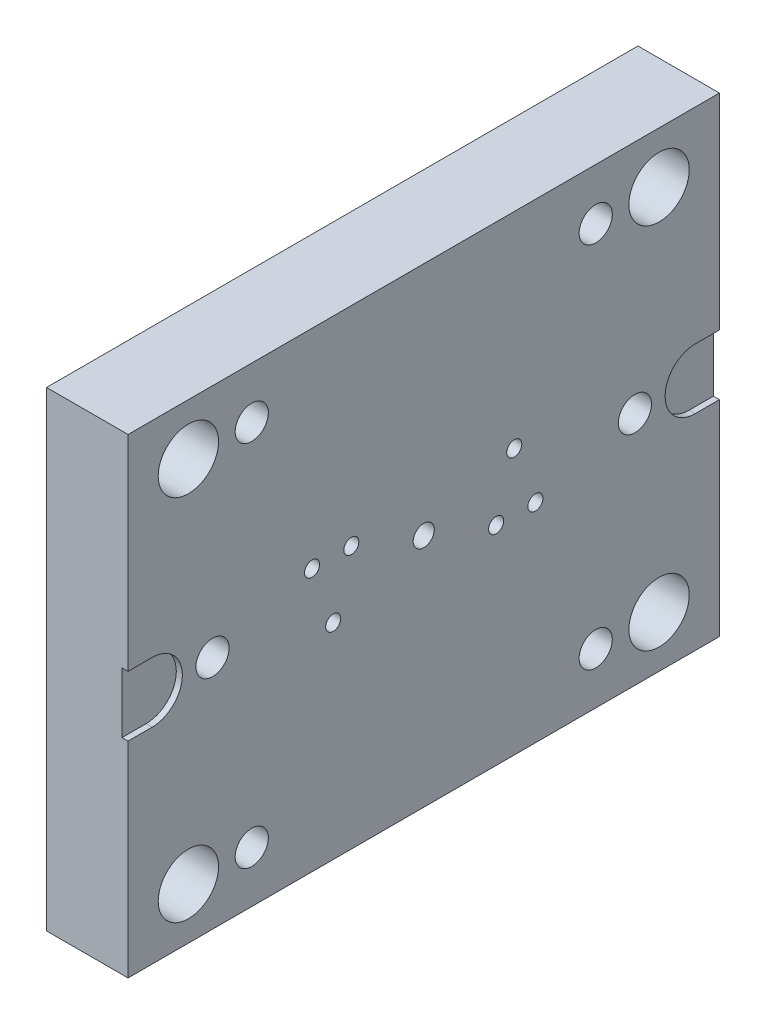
ISO-10303-21;
HEADER;
FILE_DESCRIPTION(('STEP AP214'),'2;1');
FILE_NAME('part.step','',(''),(''),'','','');
FILE_SCHEMA(('AUTOMOTIVE_DESIGN { 1 0 10303 214 1 1 1 1 }'));
ENDSEC;
DATA;
#1=APPLICATION_CONTEXT('core data for automotive mechanical design processes');
#2=APPLICATION_PROTOCOL_DEFINITION('international standard','automotive_design',2000,#1);
#3=PRODUCT_CONTEXT('',#1,'mechanical');
#4=PRODUCT('Part','Part','',(#3));
#5=PRODUCT_RELATED_PRODUCT_CATEGORY('part','',(#4));
#6=PRODUCT_DEFINITION_FORMATION('','',#4);
#7=PRODUCT_DEFINITION_CONTEXT('part definition',#1,'design');
#8=PRODUCT_DEFINITION('design','',#6,#7);
#9=PRODUCT_DEFINITION_SHAPE('','',#8);
#10=(LENGTH_UNIT() NAMED_UNIT(*) SI_UNIT(.MILLI.,.METRE.));
#11=(NAMED_UNIT(*) PLANE_ANGLE_UNIT() SI_UNIT($,.RADIAN.));
#12=(NAMED_UNIT(*) SI_UNIT($,.STERADIAN.) SOLID_ANGLE_UNIT());
#13=UNCERTAINTY_MEASURE_WITH_UNIT(LENGTH_MEASURE(1.E-05),#10,'distance_accuracy_value','');
#14=(GEOMETRIC_REPRESENTATION_CONTEXT(3) GLOBAL_UNCERTAINTY_ASSIGNED_CONTEXT((#13)) GLOBAL_UNIT_ASSIGNED_CONTEXT((#10,
#11,#12)) REPRESENTATION_CONTEXT('',''));
#15=CARTESIAN_POINT('',(0.,0.,0.));
#16=DIRECTION('',(0.,0.,1.));
#17=DIRECTION('',(1.,0.,0.));
#18=AXIS2_PLACEMENT_3D('',#15,#16,#17);
#19=CARTESIAN_POINT('',(-102.,78.,98.0000000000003));
#20=DIRECTION('',(-1.,0.,0.));
#21=DIRECTION('',(0.,0.,1.));
#22=AXIS2_PLACEMENT_3D('',#19,#20,#21);
#23=PLANE('',#22);
#24=CARTESIAN_POINT('',(-102.,77.9999999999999,168.));
#25=DIRECTION('',(1.,0.,0.));
#26=DIRECTION('',(0.,0.,-1.));
#27=AXIS2_PLACEMENT_3D('',#24,#25,#26);
#28=CIRCLE('',#27,5.50000000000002);
#29=CARTESIAN_POINT('',(-102.,77.9999999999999,162.5));
#30=VERTEX_POINT('',#29);
#31=EDGE_CURVE('E184',#30,#30,#28,.T.);
#32=ORIENTED_EDGE('',*,*,#31,.T.);
#33=EDGE_LOOP('',(#32));
#34=FACE_BOUND('',#33,.T.);
#35=CARTESIAN_POINT('',(-102.,77.9999999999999,28.0000000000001));
#36=DIRECTION('',(1.,0.,0.));
#37=DIRECTION('',(0.,0.,-1.));
#38=AXIS2_PLACEMENT_3D('',#35,#36,#37);
#39=CIRCLE('',#38,5.5);
#40=CARTESIAN_POINT('',(-102.,77.9999999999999,22.5000000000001));
#41=VERTEX_POINT('',#40);
#42=EDGE_CURVE('E190',#41,#41,#39,.T.);
#43=ORIENTED_EDGE('',*,*,#42,.T.);
#44=EDGE_LOOP('',(#43));
#45=FACE_BOUND('',#44,.T.);
#46=CARTESIAN_POINT('',(-102.,78.,98.0000000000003));
#47=DIRECTION('',(1.,0.,0.));
#48=DIRECTION('',(0.,0.,-1.));
#49=AXIS2_PLACEMENT_3D('',#46,#47,#48);
#50=CIRCLE('',#49,3.50000000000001);
#51=CARTESIAN_POINT('',(-102.,78.,94.5000000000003));
#52=VERTEX_POINT('',#51);
#53=EDGE_CURVE('E196',#52,#52,#50,.T.);
#54=ORIENTED_EDGE('',*,*,#53,.T.);
#55=EDGE_LOOP('',(#54));
#56=FACE_BOUND('',#55,.T.);
#57=CARTESIAN_POINT('',(-102.,69.,61.0000000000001));
#58=DIRECTION('',(1.,0.,0.));
#59=DIRECTION('',(0.,0.,-1.));
#60=AXIS2_PLACEMENT_3D('',#57,#58,#59);
#61=CIRCLE('',#60,2.5);
#62=CARTESIAN_POINT('',(-102.,69.,58.5000000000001));
#63=VERTEX_POINT('',#62);
#64=EDGE_CURVE('E202',#63,#63,#61,.T.);
#65=ORIENTED_EDGE('',*,*,#64,.T.);
#66=EDGE_LOOP('',(#65));
#67=FACE_BOUND('',#66,.T.);
#68=CARTESIAN_POINT('',(-102.,69.,74.0000000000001));
#69=DIRECTION('',(1.,0.,0.));
#70=DIRECTION('',(0.,0.,-1.));
#71=AXIS2_PLACEMENT_3D('',#68,#69,#70);
#72=CIRCLE('',#71,2.5);
#73=CARTESIAN_POINT('',(-102.,69.,71.5000000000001));
#74=VERTEX_POINT('',#73);
#75=EDGE_CURVE('E208',#74,#74,#72,.T.);
#76=ORIENTED_EDGE('',*,*,#75,.T.);
#77=EDGE_LOOP('',(#76));
#78=FACE_BOUND('',#77,.T.);
#79=CARTESIAN_POINT('',(-102.,88.,68.0000000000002));
#80=DIRECTION('',(1.,0.,0.));
#81=DIRECTION('',(0.,0.,-1.));
#82=AXIS2_PLACEMENT_3D('',#79,#80,#81);
#83=CIRCLE('',#82,2.50000000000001);
#84=CARTESIAN_POINT('',(-102.,88.,65.5000000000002));
#85=VERTEX_POINT('',#84);
#86=EDGE_CURVE('E214',#85,#85,#83,.T.);
#87=ORIENTED_EDGE('',*,*,#86,.T.);
#88=EDGE_LOOP('',(#87));
#89=FACE_BOUND('',#88,.T.);
#90=CARTESIAN_POINT('',(-102.,68.,128.));
#91=DIRECTION('',(1.,0.,0.));
#92=DIRECTION('',(0.,0.,-1.));
#93=AXIS2_PLACEMENT_3D('',#90,#91,#92);
#94=CIRCLE('',#93,2.5);
#95=CARTESIAN_POINT('',(-102.,68.,125.5));
#96=VERTEX_POINT('',#95);
#97=EDGE_CURVE('E220',#96,#96,#94,.T.);
#98=ORIENTED_EDGE('',*,*,#97,.T.);
#99=EDGE_LOOP('',(#98));
#100=FACE_BOUND('',#99,.T.);
#101=CARTESIAN_POINT('',(-102.,87.0000000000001,122.));
#102=DIRECTION('',(1.,0.,0.));
#103=DIRECTION('',(0.,0.,-1.));
#104=AXIS2_PLACEMENT_3D('',#101,#102,#103);
#105=CIRCLE('',#104,2.5);
#106=CARTESIAN_POINT('',(-102.,87.0000000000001,119.5));
#107=VERTEX_POINT('',#106);
#108=EDGE_CURVE('E226',#107,#107,#105,.T.);
#109=ORIENTED_EDGE('',*,*,#108,.T.);
#110=EDGE_LOOP('',(#109));
#111=FACE_BOUND('',#110,.T.);
#112=CARTESIAN_POINT('',(-102.,87.,135.));
#113=DIRECTION('',(1.,0.,0.));
#114=DIRECTION('',(0.,0.,-1.));
#115=AXIS2_PLACEMENT_3D('',#112,#113,#114);
#116=CIRCLE('',#115,2.5);
#117=CARTESIAN_POINT('',(-102.,87.,132.5));
#118=VERTEX_POINT('',#117);
#119=EDGE_CURVE('E232',#118,#118,#116,.T.);
#120=ORIENTED_EDGE('',*,*,#119,.T.);
#121=EDGE_LOOP('',(#120));
#122=FACE_BOUND('',#121,.T.);
#123=CARTESIAN_POINT('',(-102.,139.,155.));
#124=DIRECTION('',(-1.,0.,0.));
#125=DIRECTION('',(0.,0.,1.));
#126=AXIS2_PLACEMENT_3D('',#123,#124,#125);
#127=CIRCLE('',#126,5.5);
#128=CARTESIAN_POINT('',(-102.,139.,160.5));
#129=VERTEX_POINT('',#128);
#130=EDGE_CURVE('E235',#129,#129,#127,.T.);
#131=ORIENTED_EDGE('',*,*,#130,.F.);
#132=EDGE_LOOP('',(#131));
#133=FACE_BOUND('',#132,.T.);
#134=CARTESIAN_POINT('',(-102.,139.,41.0000000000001));
#135=DIRECTION('',(-1.,0.,0.));
#136=DIRECTION('',(0.,0.,1.));
#137=AXIS2_PLACEMENT_3D('',#134,#135,#136);
#138=CIRCLE('',#137,5.5);
#139=CARTESIAN_POINT('',(-102.,139.,46.5000000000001));
#140=VERTEX_POINT('',#139);
#141=EDGE_CURVE('E239',#140,#140,#138,.T.);
#142=ORIENTED_EDGE('',*,*,#141,.F.);
#143=EDGE_LOOP('',(#142));
#144=FACE_BOUND('',#143,.T.);
#145=CARTESIAN_POINT('',(-102.,17.,155.));
#146=DIRECTION('',(-1.,0.,0.));
#147=DIRECTION('',(0.,0.,1.));
#148=AXIS2_PLACEMENT_3D('',#145,#146,#147);
#149=CIRCLE('',#148,5.5);
#150=CARTESIAN_POINT('',(-102.,17.,160.5));
#151=VERTEX_POINT('',#150);
#152=EDGE_CURVE('E243',#151,#151,#149,.T.);
#153=ORIENTED_EDGE('',*,*,#152,.F.);
#154=EDGE_LOOP('',(#153));
#155=FACE_BOUND('',#154,.T.);
#156=CARTESIAN_POINT('',(-102.,17.,41.0000000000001));
#157=DIRECTION('',(-1.,0.,0.));
#158=DIRECTION('',(0.,0.,1.));
#159=AXIS2_PLACEMENT_3D('',#156,#157,#158);
#160=CIRCLE('',#159,5.5);
#161=CARTESIAN_POINT('',(-102.,17.,46.5000000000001));
#162=VERTEX_POINT('',#161);
#163=EDGE_CURVE('E247',#162,#162,#160,.T.);
#164=ORIENTED_EDGE('',*,*,#163,.F.);
#165=EDGE_LOOP('',(#164));
#166=FACE_BOUND('',#165,.T.);
#167=CARTESIAN_POINT('',(-102.,139.,176.));
#168=DIRECTION('',(-1.,0.,0.));
#169=DIRECTION('',(0.,0.,1.));
#170=AXIS2_PLACEMENT_3D('',#167,#168,#169);
#171=CIRCLE('',#170,10.);
#172=CARTESIAN_POINT('',(-102.,139.,186.));
#173=VERTEX_POINT('',#172);
#174=EDGE_CURVE('E251',#173,#173,#171,.T.);
#175=ORIENTED_EDGE('',*,*,#174,.F.);
#176=EDGE_LOOP('',(#175));
#177=FACE_BOUND('',#176,.T.);
#178=CARTESIAN_POINT('',(-102.,139.,20.0000000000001));
#179=DIRECTION('',(-1.,0.,0.));
#180=DIRECTION('',(0.,0.,1.));
#181=AXIS2_PLACEMENT_3D('',#178,#179,#180);
#182=CIRCLE('',#181,10.);
#183=CARTESIAN_POINT('',(-102.,139.,30.0000000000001));
#184=VERTEX_POINT('',#183);
#185=EDGE_CURVE('E255',#184,#184,#182,.T.);
#186=ORIENTED_EDGE('',*,*,#185,.F.);
#187=EDGE_LOOP('',(#186));
#188=FACE_BOUND('',#187,.T.);
#189=CARTESIAN_POINT('',(-102.,17.,176.));
#190=DIRECTION('',(-1.,0.,0.));
#191=DIRECTION('',(0.,0.,1.));
#192=AXIS2_PLACEMENT_3D('',#189,#190,#191);
#193=CIRCLE('',#192,10.);
#194=CARTESIAN_POINT('',(-102.,17.,186.));
#195=VERTEX_POINT('',#194);
#196=EDGE_CURVE('E259',#195,#195,#193,.T.);
#197=ORIENTED_EDGE('',*,*,#196,.F.);
#198=EDGE_LOOP('',(#197));
#199=FACE_BOUND('',#198,.T.);
#200=CARTESIAN_POINT('',(-102.,17.,20.0000000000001));
#201=DIRECTION('',(-1.,0.,0.));
#202=DIRECTION('',(0.,0.,1.));
#203=AXIS2_PLACEMENT_3D('',#200,#201,#202);
#204=CIRCLE('',#203,10.);
#205=CARTESIAN_POINT('',(-102.,17.,30.0000000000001));
#206=VERTEX_POINT('',#205);
#207=EDGE_CURVE('E263',#206,#206,#204,.T.);
#208=ORIENTED_EDGE('',*,*,#207,.F.);
#209=EDGE_LOOP('',(#208));
#210=FACE_BOUND('',#209,.T.);
#211=DIRECTION('',(0.,0.,-1.));
#212=VECTOR('',#211,1.);
#213=CARTESIAN_POINT('',(-102.,0.,98.0000000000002));
#214=LINE('',#213,#212);
#215=CARTESIAN_POINT('',(-102.,0.,196.));
#216=VERTEX_POINT('',#215);
#217=CARTESIAN_POINT('',(-102.,0.,0.));
#218=VERTEX_POINT('',#217);
#219=EDGE_CURVE('E11',#216,#218,#214,.T.);
#220=ORIENTED_EDGE('',*,*,#219,.F.);
#221=DIRECTION('',(0.,-1.,0.));
#222=VECTOR('',#221,1.);
#223=CARTESIAN_POINT('',(-102.,78.,196.));
#224=LINE('',#223,#222);
#225=CARTESIAN_POINT('',(-102.,156.,196.));
#226=VERTEX_POINT('',#225);
#227=EDGE_CURVE('E291',#226,#216,#224,.T.);
#228=ORIENTED_EDGE('',*,*,#227,.F.);
#229=DIRECTION('',(0.,0.,1.));
#230=VECTOR('',#229,1.);
#231=CARTESIAN_POINT('',(-102.,156.,98.0000000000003));
#232=LINE('',#231,#230);
#233=CARTESIAN_POINT('',(-102.,156.,0.));
#234=VERTEX_POINT('',#233);
#235=EDGE_CURVE('E294',#234,#226,#232,.T.);
#236=ORIENTED_EDGE('',*,*,#235,.F.);
#237=DIRECTION('',(0.,1.,0.));
#238=VECTOR('',#237,1.);
#239=CARTESIAN_POINT('',(-102.,78.,0.));
#240=LINE('',#239,#238);
#241=EDGE_CURVE('E36',#218,#234,#240,.T.);
#242=ORIENTED_EDGE('',*,*,#241,.F.);
#243=EDGE_LOOP('',(#220,#228,#236,#242));
#244=FACE_BOUND('',#243,.T.);
#245=ADVANCED_FACE('F28',(#34,#45,#56,#67,#78,#89,#100,#111,#122,#133,#144,#155,#166,#177,#188,
#199,#210,#244),#23,.T.);
#246=CARTESIAN_POINT('',(-75.,0.,98.0000000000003));
#247=DIRECTION('',(0.,-1.,0.));
#248=DIRECTION('',(1.,0.,0.));
#249=AXIS2_PLACEMENT_3D('',#246,#247,#248);
#250=PLANE('',#249);
#251=DIRECTION('',(-1.,0.,0.));
#252=VECTOR('',#251,1.);
#253=CARTESIAN_POINT('',(-75.,0.,196.));
#254=LINE('',#253,#252);
#255=CARTESIAN_POINT('',(-75.,0.,196.));
#256=VERTEX_POINT('',#255);
#257=EDGE_CURVE('E273',#256,#216,#254,.T.);
#258=ORIENTED_EDGE('',*,*,#257,.T.);
#259=ORIENTED_EDGE('',*,*,#219,.T.);
#260=DIRECTION('',(-1.,0.,0.));
#261=VECTOR('',#260,1.);
#262=CARTESIAN_POINT('',(-75.,0.,0.));
#263=LINE('',#262,#261);
#264=CARTESIAN_POINT('',(-75.,0.,0.));
#265=VERTEX_POINT('',#264);
#266=EDGE_CURVE('E288',#265,#218,#263,.T.);
#267=ORIENTED_EDGE('',*,*,#266,.F.);
#268=DIRECTION('',(0.,0.,1.));
#269=VECTOR('',#268,1.);
#270=CARTESIAN_POINT('',(-75.,0.,98.0000000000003));
#271=LINE('',#270,#269);
#272=EDGE_CURVE('E266',#265,#256,#271,.T.);
#273=ORIENTED_EDGE('',*,*,#272,.T.);
#274=EDGE_LOOP('',(#258,#259,#267,#273));
#275=FACE_BOUND('',#274,.T.);
#276=ADVANCED_FACE('F345',(#275),#250,.T.);
#277=CARTESIAN_POINT('',(-75.,78.0000000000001,0.));
#278=DIRECTION('',(0.,0.,-1.));
#279=DIRECTION('',(-1.,0.,0.));
#280=AXIS2_PLACEMENT_3D('',#277,#278,#279);
#281=PLANE('',#280);
#282=DIRECTION('',(1.,0.,0.));
#283=VECTOR('',#282,1.);
#284=CARTESIAN_POINT('',(-77.,88.0000000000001,0.));
#285=LINE('',#284,#283);
#286=CARTESIAN_POINT('',(-77.,88.0000000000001,0.));
#287=VERTEX_POINT('',#286);
#288=CARTESIAN_POINT('',(-75.,88.0000000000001,0.));
#289=VERTEX_POINT('',#288);
#290=EDGE_CURVE('E176',#287,#289,#285,.T.);
#291=ORIENTED_EDGE('',*,*,#290,.F.);
#292=DIRECTION('',(0.,1.,0.));
#293=VECTOR('',#292,1.);
#294=CARTESIAN_POINT('',(-77.,88.0000000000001,0.));
#295=LINE('',#294,#293);
#296=CARTESIAN_POINT('',(-77.,68.0000000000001,0.));
#297=VERTEX_POINT('',#296);
#298=EDGE_CURVE('E167',#297,#287,#295,.T.);
#299=ORIENTED_EDGE('',*,*,#298,.F.);
#300=DIRECTION('',(1.,0.,0.));
#301=VECTOR('',#300,1.);
#302=CARTESIAN_POINT('',(-77.,68.0000000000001,0.));
#303=LINE('',#302,#301);
#304=CARTESIAN_POINT('',(-75.,68.0000000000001,0.));
#305=VERTEX_POINT('',#304);
#306=EDGE_CURVE('E178',#297,#305,#303,.T.);
#307=ORIENTED_EDGE('',*,*,#306,.T.);
#308=DIRECTION('',(0.,-1.,0.));
#309=VECTOR('',#308,1.);
#310=CARTESIAN_POINT('',(-75.,78.0000000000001,0.));
#311=LINE('',#310,#309);
#312=EDGE_CURVE('E269',#305,#265,#311,.T.);
#313=ORIENTED_EDGE('',*,*,#312,.T.);
#314=ORIENTED_EDGE('',*,*,#266,.T.);
#315=ORIENTED_EDGE('',*,*,#241,.T.);
#316=DIRECTION('',(-1.,0.,0.));
#317=VECTOR('',#316,1.);
#318=CARTESIAN_POINT('',(-75.,156.,0.));
#319=LINE('',#318,#317);
#320=CARTESIAN_POINT('',(-75.,156.,0.));
#321=VERTEX_POINT('',#320);
#322=EDGE_CURVE('E285',#321,#234,#319,.T.);
#323=ORIENTED_EDGE('',*,*,#322,.F.);
#324=EDGE_CURVE('E277',#321,#289,#311,.T.);
#325=ORIENTED_EDGE('',*,*,#324,.T.);
#326=EDGE_LOOP('',(#291,#299,#307,#313,#314,#315,#323,#325));
#327=FACE_BOUND('',#326,.T.);
#328=ADVANCED_FACE('F350',(#327),#281,.T.);
#329=CARTESIAN_POINT('',(-75.,156.,98.0000000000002));
#330=DIRECTION('',(0.,1.,0.));
#331=DIRECTION('',(-1.,0.,0.));
#332=AXIS2_PLACEMENT_3D('',#329,#330,#331);
#333=PLANE('',#332);
#334=ORIENTED_EDGE('',*,*,#322,.T.);
#335=ORIENTED_EDGE('',*,*,#235,.T.);
#336=DIRECTION('',(-1.,0.,0.));
#337=VECTOR('',#336,1.);
#338=CARTESIAN_POINT('',(-75.,156.,196.000000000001));
#339=LINE('',#338,#337);
#340=CARTESIAN_POINT('',(-75.,156.,196.000000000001));
#341=VERTEX_POINT('',#340);
#342=EDGE_CURVE('E282',#341,#226,#339,.T.);
#343=ORIENTED_EDGE('',*,*,#342,.F.);
#344=DIRECTION('',(0.,0.,-1.));
#345=VECTOR('',#344,1.);
#346=CARTESIAN_POINT('',(-75.,156.,98.0000000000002));
#347=LINE('',#346,#345);
#348=EDGE_CURVE('E274',#341,#321,#347,.T.);
#349=ORIENTED_EDGE('',*,*,#348,.T.);
#350=EDGE_LOOP('',(#334,#335,#343,#349));
#351=FACE_BOUND('',#350,.T.);
#352=ADVANCED_FACE('F316',(#351),#333,.T.);
#353=CARTESIAN_POINT('',(-75.,78.0000000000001,98.0000000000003));
#354=DIRECTION('',(1.,0.,0.));
#355=DIRECTION('',(0.,0.,-1.));
#356=AXIS2_PLACEMENT_3D('',#353,#354,#355);
#357=PLANE('',#356);
#358=DIRECTION('',(0.,0.,-1.));
#359=VECTOR('',#358,1.);
#360=CARTESIAN_POINT('',(-75.,68.0000000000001,196.000000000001));
#361=LINE('',#360,#359);
#362=CARTESIAN_POINT('',(-75.,68.0000000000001,196.000000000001));
#363=VERTEX_POINT('',#362);
#364=CARTESIAN_POINT('',(-75.,68.0000000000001,188.000000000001));
#365=VERTEX_POINT('',#364);
#366=EDGE_CURVE('E140',#363,#365,#361,.T.);
#367=ORIENTED_EDGE('',*,*,#366,.F.);
#368=DIRECTION('',(0.,1.,0.));
#369=VECTOR('',#368,1.);
#370=CARTESIAN_POINT('',(-75.,78.0000000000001,196.000000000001));
#371=LINE('',#370,#369);
#372=EDGE_CURVE('E270',#256,#363,#371,.T.);
#373=ORIENTED_EDGE('',*,*,#372,.F.);
#374=ORIENTED_EDGE('',*,*,#272,.F.);
#375=ORIENTED_EDGE('',*,*,#312,.F.);
#376=DIRECTION('',(0.,0.,-1.));
#377=VECTOR('',#376,1.);
#378=CARTESIAN_POINT('',(-75.,68.0000000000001,0.));
#379=LINE('',#378,#377);
#380=CARTESIAN_POINT('',(-75.,68.0000000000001,8.00000000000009));
#381=VERTEX_POINT('',#380);
#382=EDGE_CURVE('E156',#381,#305,#379,.T.);
#383=ORIENTED_EDGE('',*,*,#382,.F.);
#384=CARTESIAN_POINT('',(-75.,78.0000000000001,8.00000000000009));
#385=DIRECTION('',(1.,0.,0.));
#386=DIRECTION('',(0.,0.,-1.));
#387=AXIS2_PLACEMENT_3D('',#384,#385,#386);
#388=CIRCLE('',#387,9.99999999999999);
#389=CARTESIAN_POINT('',(-75.,88.0000000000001,8.00000000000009));
#390=VERTEX_POINT('',#389);
#391=EDGE_CURVE('E52',#390,#381,#388,.T.);
#392=ORIENTED_EDGE('',*,*,#391,.F.);
#393=DIRECTION('',(0.,0.,1.));
#394=VECTOR('',#393,1.);
#395=CARTESIAN_POINT('',(-75.,88.0000000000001,8.00000000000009));
#396=LINE('',#395,#394);
#397=EDGE_CURVE('E158',#289,#390,#396,.T.);
#398=ORIENTED_EDGE('',*,*,#397,.F.);
#399=ORIENTED_EDGE('',*,*,#324,.F.);
#400=ORIENTED_EDGE('',*,*,#348,.F.);
#401=CARTESIAN_POINT('',(-75.,88.0000000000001,196.000000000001));
#402=VERTEX_POINT('',#401);
#403=EDGE_CURVE('E139',#402,#341,#371,.T.);
#404=ORIENTED_EDGE('',*,*,#403,.F.);
#405=DIRECTION('',(0.,0.,1.));
#406=VECTOR('',#405,1.);
#407=CARTESIAN_POINT('',(-75.,88.0000000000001,188.000000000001));
#408=LINE('',#407,#406);
#409=CARTESIAN_POINT('',(-75.,88.0000000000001,188.000000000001));
#410=VERTEX_POINT('',#409);
#411=EDGE_CURVE('E120',#410,#402,#408,.T.);
#412=ORIENTED_EDGE('',*,*,#411,.F.);
#413=CARTESIAN_POINT('',(-75.,78.0000000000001,188.000000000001));
#414=DIRECTION('',(1.,0.,0.));
#415=DIRECTION('',(0.,0.,1.));
#416=AXIS2_PLACEMENT_3D('',#413,#414,#415);
#417=CIRCLE('',#416,9.99999999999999);
#418=EDGE_CURVE('E128',#365,#410,#417,.T.);
#419=ORIENTED_EDGE('',*,*,#418,.F.);
#420=EDGE_LOOP('',(#367,#373,#374,#375,#383,#392,#398,#399,#400,#404,#412,#419));
#421=FACE_BOUND('',#420,.T.);
#422=CARTESIAN_POINT('',(-75.,77.9999999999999,168.));
#423=DIRECTION('',(1.,0.,0.));
#424=DIRECTION('',(0.,0.,-1.));
#425=AXIS2_PLACEMENT_3D('',#422,#423,#424);
#426=CIRCLE('',#425,5.50000000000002);
#427=CARTESIAN_POINT('',(-75.,77.9999999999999,162.5));
#428=VERTEX_POINT('',#427);
#429=EDGE_CURVE('E175',#428,#428,#426,.T.);
#430=ORIENTED_EDGE('',*,*,#429,.F.);
#431=EDGE_LOOP('',(#430));
#432=FACE_BOUND('',#431,.T.);
#433=CARTESIAN_POINT('',(-74.9999999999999,78.,28.0000000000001));
#434=DIRECTION('',(1.,0.,0.));
#435=DIRECTION('',(0.,0.,-1.));
#436=AXIS2_PLACEMENT_3D('',#433,#434,#435);
#437=CIRCLE('',#436,5.5);
#438=CARTESIAN_POINT('',(-74.9999999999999,78.,22.5000000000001));
#439=VERTEX_POINT('',#438);
#440=EDGE_CURVE('E187',#439,#439,#437,.T.);
#441=ORIENTED_EDGE('',*,*,#440,.F.);
#442=EDGE_LOOP('',(#441));
#443=FACE_BOUND('',#442,.T.);
#444=CARTESIAN_POINT('',(-75.,78.0000000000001,98.0000000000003));
#445=DIRECTION('',(1.,0.,0.));
#446=DIRECTION('',(0.,0.,-1.));
#447=AXIS2_PLACEMENT_3D('',#444,#445,#446);
#448=CIRCLE('',#447,3.50000000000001);
#449=CARTESIAN_POINT('',(-75.,78.0000000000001,94.5000000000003));
#450=VERTEX_POINT('',#449);
#451=EDGE_CURVE('E193',#450,#450,#448,.T.);
#452=ORIENTED_EDGE('',*,*,#451,.F.);
#453=EDGE_LOOP('',(#452));
#454=FACE_BOUND('',#453,.T.);
#455=CARTESIAN_POINT('',(-75.,69.0000000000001,61.0000000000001));
#456=DIRECTION('',(1.,0.,0.));
#457=DIRECTION('',(0.,0.,-1.));
#458=AXIS2_PLACEMENT_3D('',#455,#456,#457);
#459=CIRCLE('',#458,2.5);
#460=CARTESIAN_POINT('',(-75.,69.0000000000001,58.5000000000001));
#461=VERTEX_POINT('',#460);
#462=EDGE_CURVE('E199',#461,#461,#459,.T.);
#463=ORIENTED_EDGE('',*,*,#462,.F.);
#464=EDGE_LOOP('',(#463));
#465=FACE_BOUND('',#464,.T.);
#466=CARTESIAN_POINT('',(-75.,69.0000000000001,74.0000000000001));
#467=DIRECTION('',(1.,0.,0.));
#468=DIRECTION('',(0.,0.,-1.));
#469=AXIS2_PLACEMENT_3D('',#466,#467,#468);
#470=CIRCLE('',#469,2.5);
#471=CARTESIAN_POINT('',(-75.,69.0000000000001,71.5000000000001));
#472=VERTEX_POINT('',#471);
#473=EDGE_CURVE('E205',#472,#472,#470,.T.);
#474=ORIENTED_EDGE('',*,*,#473,.F.);
#475=EDGE_LOOP('',(#474));
#476=FACE_BOUND('',#475,.T.);
#477=CARTESIAN_POINT('',(-75.,88.0000000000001,68.0000000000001));
#478=DIRECTION('',(1.,0.,0.));
#479=DIRECTION('',(0.,0.,-1.));
#480=AXIS2_PLACEMENT_3D('',#477,#478,#479);
#481=CIRCLE('',#480,2.50000000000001);
#482=CARTESIAN_POINT('',(-75.,88.0000000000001,65.5000000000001));
#483=VERTEX_POINT('',#482);
#484=EDGE_CURVE('E211',#483,#483,#481,.T.);
#485=ORIENTED_EDGE('',*,*,#484,.F.);
#486=EDGE_LOOP('',(#485));
#487=FACE_BOUND('',#486,.T.);
#488=CARTESIAN_POINT('',(-75.,68.,128.));
#489=DIRECTION('',(1.,0.,0.));
#490=DIRECTION('',(0.,0.,-1.));
#491=AXIS2_PLACEMENT_3D('',#488,#489,#490);
#492=CIRCLE('',#491,2.5);
#493=CARTESIAN_POINT('',(-75.,68.,125.5));
#494=VERTEX_POINT('',#493);
#495=EDGE_CURVE('E217',#494,#494,#492,.T.);
#496=ORIENTED_EDGE('',*,*,#495,.F.);
#497=EDGE_LOOP('',(#496));
#498=FACE_BOUND('',#497,.T.);
#499=CARTESIAN_POINT('',(-75.,87.0000000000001,122.));
#500=DIRECTION('',(1.,0.,0.));
#501=DIRECTION('',(0.,0.,-1.));
#502=AXIS2_PLACEMENT_3D('',#499,#500,#501);
#503=CIRCLE('',#502,2.5);
#504=CARTESIAN_POINT('',(-75.,87.0000000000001,119.5));
#505=VERTEX_POINT('',#504);
#506=EDGE_CURVE('E223',#505,#505,#503,.T.);
#507=ORIENTED_EDGE('',*,*,#506,.F.);
#508=EDGE_LOOP('',(#507));
#509=FACE_BOUND('',#508,.T.);
#510=CARTESIAN_POINT('',(-75.,87.,135.));
#511=DIRECTION('',(1.,0.,0.));
#512=DIRECTION('',(0.,0.,-1.));
#513=AXIS2_PLACEMENT_3D('',#510,#511,#512);
#514=CIRCLE('',#513,2.5);
#515=CARTESIAN_POINT('',(-75.,87.,132.5));
#516=VERTEX_POINT('',#515);
#517=EDGE_CURVE('E229',#516,#516,#514,.T.);
#518=ORIENTED_EDGE('',*,*,#517,.F.);
#519=EDGE_LOOP('',(#518));
#520=FACE_BOUND('',#519,.T.);
#521=CARTESIAN_POINT('',(-75.0000000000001,139.,155.));
#522=DIRECTION('',(1.,0.,0.));
#523=DIRECTION('',(0.,0.,-1.));
#524=AXIS2_PLACEMENT_3D('',#521,#522,#523);
#525=CIRCLE('',#524,5.5);
#526=CARTESIAN_POINT('',(-75.0000000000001,139.,149.5));
#527=VERTEX_POINT('',#526);
#528=EDGE_CURVE('E31',#527,#527,#525,.T.);
#529=ORIENTED_EDGE('',*,*,#528,.F.);
#530=EDGE_LOOP('',(#529));
#531=FACE_BOUND('',#530,.T.);
#532=CARTESIAN_POINT('',(-75.,139.,41.0000000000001));
#533=DIRECTION('',(1.,0.,0.));
#534=DIRECTION('',(0.,0.,-1.));
#535=AXIS2_PLACEMENT_3D('',#532,#533,#534);
#536=CIRCLE('',#535,5.5);
#537=CARTESIAN_POINT('',(-75.,139.,35.5000000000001));
#538=VERTEX_POINT('',#537);
#539=EDGE_CURVE('E238',#538,#538,#536,.T.);
#540=ORIENTED_EDGE('',*,*,#539,.F.);
#541=EDGE_LOOP('',(#540));
#542=FACE_BOUND('',#541,.T.);
#543=CARTESIAN_POINT('',(-75.,16.9999999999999,155.));
#544=DIRECTION('',(1.,0.,0.));
#545=DIRECTION('',(0.,0.,-1.));
#546=AXIS2_PLACEMENT_3D('',#543,#544,#545);
#547=CIRCLE('',#546,5.5);
#548=CARTESIAN_POINT('',(-75.,16.9999999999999,149.5));
#549=VERTEX_POINT('',#548);
#550=EDGE_CURVE('E242',#549,#549,#547,.T.);
#551=ORIENTED_EDGE('',*,*,#550,.F.);
#552=EDGE_LOOP('',(#551));
#553=FACE_BOUND('',#552,.T.);
#554=CARTESIAN_POINT('',(-75.,17.,41.0000000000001));
#555=DIRECTION('',(1.,0.,0.));
#556=DIRECTION('',(0.,0.,-1.));
#557=AXIS2_PLACEMENT_3D('',#554,#555,#556);
#558=CIRCLE('',#557,5.5);
#559=CARTESIAN_POINT('',(-75.,17.,35.5000000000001));
#560=VERTEX_POINT('',#559);
#561=EDGE_CURVE('E246',#560,#560,#558,.T.);
#562=ORIENTED_EDGE('',*,*,#561,.F.);
#563=EDGE_LOOP('',(#562));
#564=FACE_BOUND('',#563,.T.);
#565=CARTESIAN_POINT('',(-75.,139.,176.));
#566=DIRECTION('',(1.,0.,0.));
#567=DIRECTION('',(0.,0.,-1.));
#568=AXIS2_PLACEMENT_3D('',#565,#566,#567);
#569=CIRCLE('',#568,10.);
#570=CARTESIAN_POINT('',(-75.,139.,166.));
#571=VERTEX_POINT('',#570);
#572=EDGE_CURVE('E250',#571,#571,#569,.T.);
#573=ORIENTED_EDGE('',*,*,#572,.F.);
#574=EDGE_LOOP('',(#573));
#575=FACE_BOUND('',#574,.T.);
#576=CARTESIAN_POINT('',(-75.,139.,20.0000000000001));
#577=DIRECTION('',(1.,0.,0.));
#578=DIRECTION('',(0.,0.,-1.));
#579=AXIS2_PLACEMENT_3D('',#576,#577,#578);
#580=CIRCLE('',#579,10.);
#581=CARTESIAN_POINT('',(-75.,139.,10.0000000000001));
#582=VERTEX_POINT('',#581);
#583=EDGE_CURVE('E254',#582,#582,#580,.T.);
#584=ORIENTED_EDGE('',*,*,#583,.F.);
#585=EDGE_LOOP('',(#584));
#586=FACE_BOUND('',#585,.T.);
#587=CARTESIAN_POINT('',(-75.,17.,176.));
#588=DIRECTION('',(1.,0.,0.));
#589=DIRECTION('',(0.,0.,-1.));
#590=AXIS2_PLACEMENT_3D('',#587,#588,#589);
#591=CIRCLE('',#590,10.);
#592=CARTESIAN_POINT('',(-75.,17.,166.));
#593=VERTEX_POINT('',#592);
#594=EDGE_CURVE('E258',#593,#593,#591,.T.);
#595=ORIENTED_EDGE('',*,*,#594,.F.);
#596=EDGE_LOOP('',(#595));
#597=FACE_BOUND('',#596,.T.);
#598=CARTESIAN_POINT('',(-75.,16.9999999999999,20.0000000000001));
#599=DIRECTION('',(1.,0.,0.));
#600=DIRECTION('',(0.,0.,-1.));
#601=AXIS2_PLACEMENT_3D('',#598,#599,#600);
#602=CIRCLE('',#601,10.);
#603=CARTESIAN_POINT('',(-75.,16.9999999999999,10.0000000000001));
#604=VERTEX_POINT('',#603);
#605=EDGE_CURVE('E262',#604,#604,#602,.T.);
#606=ORIENTED_EDGE('',*,*,#605,.F.);
#607=EDGE_LOOP('',(#606));
#608=FACE_BOUND('',#607,.T.);
#609=ADVANCED_FACE('F136',(#421,#432,#443,#454,#465,#476,#487,#498,#509,#520,#531,#542,#553,
#564,#575,#586,#597,#608),#357,.T.);
#610=CARTESIAN_POINT('',(-75.,78.0000000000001,196.000000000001));
#611=DIRECTION('',(0.,0.,1.));
#612=DIRECTION('',(1.,0.,0.));
#613=AXIS2_PLACEMENT_3D('',#610,#611,#612);
#614=PLANE('',#613);
#615=DIRECTION('',(1.,0.,0.));
#616=VECTOR('',#615,1.);
#617=CARTESIAN_POINT('',(-77.,68.0000000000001,196.000000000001));
#618=LINE('',#617,#616);
#619=CARTESIAN_POINT('',(-77.,68.0000000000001,196.000000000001));
#620=VERTEX_POINT('',#619);
#621=EDGE_CURVE('E152',#620,#363,#618,.T.);
#622=ORIENTED_EDGE('',*,*,#621,.F.);
#623=DIRECTION('',(0.,-1.,0.));
#624=VECTOR('',#623,1.);
#625=CARTESIAN_POINT('',(-77.,88.0000000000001,196.000000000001));
#626=LINE('',#625,#624);
#627=CARTESIAN_POINT('',(-77.,88.0000000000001,196.000000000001));
#628=VERTEX_POINT('',#627);
#629=EDGE_CURVE('E147',#628,#620,#626,.T.);
#630=ORIENTED_EDGE('',*,*,#629,.F.);
#631=DIRECTION('',(1.,0.,0.));
#632=VECTOR('',#631,1.);
#633=CARTESIAN_POINT('',(-77.,88.0000000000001,196.000000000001));
#634=LINE('',#633,#632);
#635=EDGE_CURVE('E124',#628,#402,#634,.T.);
#636=ORIENTED_EDGE('',*,*,#635,.T.);
#637=ORIENTED_EDGE('',*,*,#403,.T.);
#638=ORIENTED_EDGE('',*,*,#342,.T.);
#639=ORIENTED_EDGE('',*,*,#227,.T.);
#640=ORIENTED_EDGE('',*,*,#257,.F.);
#641=ORIENTED_EDGE('',*,*,#372,.T.);
#642=EDGE_LOOP('',(#622,#630,#636,#637,#638,#639,#640,#641));
#643=FACE_BOUND('',#642,.T.);
#644=ADVANCED_FACE('F315',(#643),#614,.T.);
#645=CARTESIAN_POINT('',(3.,17.,20.));
#646=DIRECTION('',(-1.,0.,0.));
#647=DIRECTION('',(0.,1.,0.));
#648=AXIS2_PLACEMENT_3D('',#645,#646,#647);
#649=CYLINDRICAL_SURFACE('',#648,10.);
#650=ORIENTED_EDGE('',*,*,#207,.T.);
#651=EDGE_LOOP('',(#650));
#652=FACE_BOUND('',#651,.T.);
#653=ORIENTED_EDGE('',*,*,#605,.T.);
#654=EDGE_LOOP('',(#653));
#655=FACE_BOUND('',#654,.T.);
#656=ADVANCED_FACE('F330',(#652,#655),#649,.F.);
#657=CARTESIAN_POINT('',(3.,17.,176.));
#658=DIRECTION('',(-1.,0.,0.));
#659=DIRECTION('',(0.,1.,0.));
#660=AXIS2_PLACEMENT_3D('',#657,#658,#659);
#661=CYLINDRICAL_SURFACE('',#660,10.);
#662=ORIENTED_EDGE('',*,*,#196,.T.);
#663=EDGE_LOOP('',(#662));
#664=FACE_BOUND('',#663,.T.);
#665=ORIENTED_EDGE('',*,*,#594,.T.);
#666=EDGE_LOOP('',(#665));
#667=FACE_BOUND('',#666,.T.);
#668=ADVANCED_FACE('F332',(#664,#667),#661,.F.);
#669=CARTESIAN_POINT('',(3.,139.,20.0000000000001));
#670=DIRECTION('',(-1.,0.,0.));
#671=DIRECTION('',(0.,1.,0.));
#672=AXIS2_PLACEMENT_3D('',#669,#670,#671);
#673=CYLINDRICAL_SURFACE('',#672,10.);
#674=ORIENTED_EDGE('',*,*,#185,.T.);
#675=EDGE_LOOP('',(#674));
#676=FACE_BOUND('',#675,.T.);
#677=ORIENTED_EDGE('',*,*,#583,.T.);
#678=EDGE_LOOP('',(#677));
#679=FACE_BOUND('',#678,.T.);
#680=ADVANCED_FACE('F339',(#676,#679),#673,.F.);
#681=CARTESIAN_POINT('',(3.00000000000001,139.,176.));
#682=DIRECTION('',(-1.,0.,0.));
#683=DIRECTION('',(0.,1.,0.));
#684=AXIS2_PLACEMENT_3D('',#681,#682,#683);
#685=CYLINDRICAL_SURFACE('',#684,10.);
#686=ORIENTED_EDGE('',*,*,#174,.T.);
#687=EDGE_LOOP('',(#686));
#688=FACE_BOUND('',#687,.T.);
#689=ORIENTED_EDGE('',*,*,#572,.T.);
#690=EDGE_LOOP('',(#689));
#691=FACE_BOUND('',#690,.T.);
#692=ADVANCED_FACE('F476',(#688,#691),#685,.F.);
#693=CARTESIAN_POINT('',(-149.,17.,41.0000000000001));
#694=DIRECTION('',(1.,0.,0.));
#695=DIRECTION('',(0.,-1.,0.));
#696=AXIS2_PLACEMENT_3D('',#693,#694,#695);
#697=CYLINDRICAL_SURFACE('',#696,5.5);
#698=ORIENTED_EDGE('',*,*,#163,.T.);
#699=EDGE_LOOP('',(#698));
#700=FACE_BOUND('',#699,.T.);
#701=ORIENTED_EDGE('',*,*,#561,.T.);
#702=EDGE_LOOP('',(#701));
#703=FACE_BOUND('',#702,.T.);
#704=ADVANCED_FACE('F472',(#700,#703),#697,.F.);
#705=CARTESIAN_POINT('',(-149.,17.,155.));
#706=DIRECTION('',(1.,0.,0.));
#707=DIRECTION('',(0.,-1.,0.));
#708=AXIS2_PLACEMENT_3D('',#705,#706,#707);
#709=CYLINDRICAL_SURFACE('',#708,5.5);
#710=ORIENTED_EDGE('',*,*,#152,.T.);
#711=EDGE_LOOP('',(#710));
#712=FACE_BOUND('',#711,.T.);
#713=ORIENTED_EDGE('',*,*,#550,.T.);
#714=EDGE_LOOP('',(#713));
#715=FACE_BOUND('',#714,.T.);
#716=ADVANCED_FACE('F468',(#712,#715),#709,.F.);
#717=CARTESIAN_POINT('',(-149.,139.,41.0000000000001));
#718=DIRECTION('',(1.,0.,0.));
#719=DIRECTION('',(0.,-1.,0.));
#720=AXIS2_PLACEMENT_3D('',#717,#718,#719);
#721=CYLINDRICAL_SURFACE('',#720,5.5);
#722=ORIENTED_EDGE('',*,*,#141,.T.);
#723=EDGE_LOOP('',(#722));
#724=FACE_BOUND('',#723,.T.);
#725=ORIENTED_EDGE('',*,*,#539,.T.);
#726=EDGE_LOOP('',(#725));
#727=FACE_BOUND('',#726,.T.);
#728=ADVANCED_FACE('F311',(#724,#727),#721,.F.);
#729=CARTESIAN_POINT('',(-149.,139.,155.));
#730=DIRECTION('',(1.,0.,0.));
#731=DIRECTION('',(0.,-1.,0.));
#732=AXIS2_PLACEMENT_3D('',#729,#730,#731);
#733=CYLINDRICAL_SURFACE('',#732,5.5);
#734=ORIENTED_EDGE('',*,*,#130,.T.);
#735=EDGE_LOOP('',(#734));
#736=FACE_BOUND('',#735,.T.);
#737=ORIENTED_EDGE('',*,*,#528,.T.);
#738=EDGE_LOOP('',(#737));
#739=FACE_BOUND('',#738,.T.);
#740=ADVANCED_FACE('F461',(#736,#739),#733,.F.);
#741=CARTESIAN_POINT('',(-102.,87.,135.));
#742=DIRECTION('',(1.,0.,0.));
#743=DIRECTION('',(0.,0.,-1.));
#744=AXIS2_PLACEMENT_3D('',#741,#742,#743);
#745=CYLINDRICAL_SURFACE('',#744,2.5);
#746=ORIENTED_EDGE('',*,*,#119,.F.);
#747=EDGE_LOOP('',(#746));
#748=FACE_BOUND('',#747,.T.);
#749=ORIENTED_EDGE('',*,*,#517,.T.);
#750=EDGE_LOOP('',(#749));
#751=FACE_BOUND('',#750,.T.);
#752=ADVANCED_FACE('F457',(#748,#751),#745,.F.);
#753=CARTESIAN_POINT('',(-102.,87.0000000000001,122.));
#754=DIRECTION('',(1.,0.,0.));
#755=DIRECTION('',(0.,0.,-1.));
#756=AXIS2_PLACEMENT_3D('',#753,#754,#755);
#757=CYLINDRICAL_SURFACE('',#756,2.5);
#758=ORIENTED_EDGE('',*,*,#108,.F.);
#759=EDGE_LOOP('',(#758));
#760=FACE_BOUND('',#759,.T.);
#761=ORIENTED_EDGE('',*,*,#506,.T.);
#762=EDGE_LOOP('',(#761));
#763=FACE_BOUND('',#762,.T.);
#764=ADVANCED_FACE('F453',(#760,#763),#757,.F.);
#765=CARTESIAN_POINT('',(-102.,68.,128.));
#766=DIRECTION('',(1.,0.,0.));
#767=DIRECTION('',(0.,0.,-1.));
#768=AXIS2_PLACEMENT_3D('',#765,#766,#767);
#769=CYLINDRICAL_SURFACE('',#768,2.5);
#770=ORIENTED_EDGE('',*,*,#97,.F.);
#771=EDGE_LOOP('',(#770));
#772=FACE_BOUND('',#771,.T.);
#773=ORIENTED_EDGE('',*,*,#495,.T.);
#774=EDGE_LOOP('',(#773));
#775=FACE_BOUND('',#774,.T.);
#776=ADVANCED_FACE('F449',(#772,#775),#769,.F.);
#777=CARTESIAN_POINT('',(-102.,88.,68.0000000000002));
#778=DIRECTION('',(1.,0.,0.));
#779=DIRECTION('',(0.,0.,-1.));
#780=AXIS2_PLACEMENT_3D('',#777,#778,#779);
#781=CYLINDRICAL_SURFACE('',#780,2.50000000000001);
#782=ORIENTED_EDGE('',*,*,#86,.F.);
#783=EDGE_LOOP('',(#782));
#784=FACE_BOUND('',#783,.T.);
#785=ORIENTED_EDGE('',*,*,#484,.T.);
#786=EDGE_LOOP('',(#785));
#787=FACE_BOUND('',#786,.T.);
#788=ADVANCED_FACE('F445',(#784,#787),#781,.F.);
#789=CARTESIAN_POINT('',(-102.,69.,74.0000000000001));
#790=DIRECTION('',(1.,0.,0.));
#791=DIRECTION('',(0.,0.,-1.));
#792=AXIS2_PLACEMENT_3D('',#789,#790,#791);
#793=CYLINDRICAL_SURFACE('',#792,2.5);
#794=ORIENTED_EDGE('',*,*,#75,.F.);
#795=EDGE_LOOP('',(#794));
#796=FACE_BOUND('',#795,.T.);
#797=ORIENTED_EDGE('',*,*,#473,.T.);
#798=EDGE_LOOP('',(#797));
#799=FACE_BOUND('',#798,.T.);
#800=ADVANCED_FACE('F441',(#796,#799),#793,.F.);
#801=CARTESIAN_POINT('',(-102.,69.,61.0000000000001));
#802=DIRECTION('',(1.,0.,0.));
#803=DIRECTION('',(0.,0.,-1.));
#804=AXIS2_PLACEMENT_3D('',#801,#802,#803);
#805=CYLINDRICAL_SURFACE('',#804,2.5);
#806=ORIENTED_EDGE('',*,*,#64,.F.);
#807=EDGE_LOOP('',(#806));
#808=FACE_BOUND('',#807,.T.);
#809=ORIENTED_EDGE('',*,*,#462,.T.);
#810=EDGE_LOOP('',(#809));
#811=FACE_BOUND('',#810,.T.);
#812=ADVANCED_FACE('F437',(#808,#811),#805,.F.);
#813=CARTESIAN_POINT('',(-102.,78.,98.0000000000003));
#814=DIRECTION('',(1.,0.,0.));
#815=DIRECTION('',(0.,0.,-1.));
#816=AXIS2_PLACEMENT_3D('',#813,#814,#815);
#817=CYLINDRICAL_SURFACE('',#816,3.50000000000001);
#818=ORIENTED_EDGE('',*,*,#53,.F.);
#819=EDGE_LOOP('',(#818));
#820=FACE_BOUND('',#819,.T.);
#821=ORIENTED_EDGE('',*,*,#451,.T.);
#822=EDGE_LOOP('',(#821));
#823=FACE_BOUND('',#822,.T.);
#824=ADVANCED_FACE('F433',(#820,#823),#817,.F.);
#825=CARTESIAN_POINT('',(-102.,77.9999999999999,28.0000000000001));
#826=DIRECTION('',(1.,0.,0.));
#827=DIRECTION('',(0.,0.,-1.));
#828=AXIS2_PLACEMENT_3D('',#825,#826,#827);
#829=CYLINDRICAL_SURFACE('',#828,5.5);
#830=ORIENTED_EDGE('',*,*,#42,.F.);
#831=EDGE_LOOP('',(#830));
#832=FACE_BOUND('',#831,.T.);
#833=ORIENTED_EDGE('',*,*,#440,.T.);
#834=EDGE_LOOP('',(#833));
#835=FACE_BOUND('',#834,.T.);
#836=ADVANCED_FACE('F429',(#832,#835),#829,.F.);
#837=CARTESIAN_POINT('',(-102.,77.9999999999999,168.));
#838=DIRECTION('',(1.,0.,0.));
#839=DIRECTION('',(0.,0.,-1.));
#840=AXIS2_PLACEMENT_3D('',#837,#838,#839);
#841=CYLINDRICAL_SURFACE('',#840,5.50000000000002);
#842=ORIENTED_EDGE('',*,*,#31,.F.);
#843=EDGE_LOOP('',(#842));
#844=FACE_BOUND('',#843,.T.);
#845=ORIENTED_EDGE('',*,*,#429,.T.);
#846=EDGE_LOOP('',(#845));
#847=FACE_BOUND('',#846,.T.);
#848=ADVANCED_FACE('F426',(#844,#847),#841,.F.);
#849=CARTESIAN_POINT('',(-77.,78.0000000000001,8.00000000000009));
#850=DIRECTION('',(1.,0.,0.));
#851=DIRECTION('',(0.,0.,-1.));
#852=AXIS2_PLACEMENT_3D('',#849,#850,#851);
#853=CYLINDRICAL_SURFACE('',#852,9.99999999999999);
#854=ORIENTED_EDGE('',*,*,#391,.T.);
#855=DIRECTION('',(1.,0.,0.));
#856=VECTOR('',#855,1.);
#857=CARTESIAN_POINT('',(-77.,68.0000000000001,8.00000000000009));
#858=LINE('',#857,#856);
#859=CARTESIAN_POINT('',(-77.,68.0000000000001,8.00000000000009));
#860=VERTEX_POINT('',#859);
#861=EDGE_CURVE('E172',#860,#381,#858,.T.);
#862=ORIENTED_EDGE('',*,*,#861,.F.);
#863=CARTESIAN_POINT('',(-77.,78.0000000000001,8.00000000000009));
#864=DIRECTION('',(1.,0.,0.));
#865=DIRECTION('',(0.,0.,-1.));
#866=AXIS2_PLACEMENT_3D('',#863,#864,#865);
#867=CIRCLE('',#866,9.99999999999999);
#868=CARTESIAN_POINT('',(-77.,88.0000000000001,8.00000000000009));
#869=VERTEX_POINT('',#868);
#870=EDGE_CURVE('E161',#869,#860,#867,.T.);
#871=ORIENTED_EDGE('',*,*,#870,.F.);
#872=DIRECTION('',(1.,0.,0.));
#873=VECTOR('',#872,1.);
#874=CARTESIAN_POINT('',(-77.,88.0000000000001,8.00000000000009));
#875=LINE('',#874,#873);
#876=EDGE_CURVE('E173',#869,#390,#875,.T.);
#877=ORIENTED_EDGE('',*,*,#876,.T.);
#878=EDGE_LOOP('',(#854,#862,#871,#877));
#879=FACE_BOUND('',#878,.T.);
#880=ADVANCED_FACE('F419',(#879),#853,.F.);
#881=CARTESIAN_POINT('',(-77.,88.0000000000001,8.00000000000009));
#882=DIRECTION('',(0.,1.,0.));
#883=DIRECTION('',(0.,0.,1.));
#884=AXIS2_PLACEMENT_3D('',#881,#882,#883);
#885=PLANE('',#884);
#886=ORIENTED_EDGE('',*,*,#397,.T.);
#887=ORIENTED_EDGE('',*,*,#876,.F.);
#888=DIRECTION('',(0.,0.,1.));
#889=VECTOR('',#888,1.);
#890=CARTESIAN_POINT('',(-77.,88.0000000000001,8.00000000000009));
#891=LINE('',#890,#889);
#892=EDGE_CURVE('E169',#287,#869,#891,.T.);
#893=ORIENTED_EDGE('',*,*,#892,.F.);
#894=ORIENTED_EDGE('',*,*,#290,.T.);
#895=EDGE_LOOP('',(#886,#887,#893,#894));
#896=FACE_BOUND('',#895,.T.);
#897=ADVANCED_FACE('F416',(#896),#885,.F.);
#898=CARTESIAN_POINT('',(-77.,68.0000000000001,0.));
#899=DIRECTION('',(0.,-1.,0.));
#900=DIRECTION('',(0.,0.,-1.));
#901=AXIS2_PLACEMENT_3D('',#898,#899,#900);
#902=PLANE('',#901);
#903=ORIENTED_EDGE('',*,*,#382,.T.);
#904=ORIENTED_EDGE('',*,*,#306,.F.);
#905=DIRECTION('',(0.,0.,-1.));
#906=VECTOR('',#905,1.);
#907=CARTESIAN_POINT('',(-77.,68.0000000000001,0.));
#908=LINE('',#907,#906);
#909=EDGE_CURVE('E164',#860,#297,#908,.T.);
#910=ORIENTED_EDGE('',*,*,#909,.F.);
#911=ORIENTED_EDGE('',*,*,#861,.T.);
#912=EDGE_LOOP('',(#903,#904,#910,#911));
#913=FACE_BOUND('',#912,.T.);
#914=ADVANCED_FACE('F414',(#913),#902,.F.);
#915=CARTESIAN_POINT('',(-77.,78.0000000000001,8.00000000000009));
#916=DIRECTION('',(1.,0.,0.));
#917=DIRECTION('',(0.,0.,-1.));
#918=AXIS2_PLACEMENT_3D('',#915,#916,#917);
#919=PLANE('',#918);
#920=ORIENTED_EDGE('',*,*,#870,.T.);
#921=ORIENTED_EDGE('',*,*,#909,.T.);
#922=ORIENTED_EDGE('',*,*,#298,.T.);
#923=ORIENTED_EDGE('',*,*,#892,.T.);
#924=EDGE_LOOP('',(#920,#921,#922,#923));
#925=FACE_BOUND('',#924,.T.);
#926=ADVANCED_FACE('F411',(#925),#919,.T.);
#927=CARTESIAN_POINT('',(-77.,78.0000000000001,188.000000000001));
#928=DIRECTION('',(1.,0.,0.));
#929=DIRECTION('',(0.,0.,-1.));
#930=AXIS2_PLACEMENT_3D('',#927,#928,#929);
#931=CYLINDRICAL_SURFACE('',#930,9.99999999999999);
#932=ORIENTED_EDGE('',*,*,#418,.T.);
#933=DIRECTION('',(1.,0.,0.));
#934=VECTOR('',#933,1.);
#935=CARTESIAN_POINT('',(-77.,88.0000000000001,188.000000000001));
#936=LINE('',#935,#934);
#937=CARTESIAN_POINT('',(-77.,88.0000000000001,188.000000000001));
#938=VERTEX_POINT('',#937);
#939=EDGE_CURVE('E116',#938,#410,#936,.T.);
#940=ORIENTED_EDGE('',*,*,#939,.F.);
#941=CARTESIAN_POINT('',(-77.,78.0000000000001,188.000000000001));
#942=DIRECTION('',(1.,0.,0.));
#943=DIRECTION('',(0.,0.,1.));
#944=AXIS2_PLACEMENT_3D('',#941,#942,#943);
#945=CIRCLE('',#944,9.99999999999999);
#946=CARTESIAN_POINT('',(-77.,68.0000000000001,188.000000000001));
#947=VERTEX_POINT('',#946);
#948=EDGE_CURVE('E142',#947,#938,#945,.T.);
#949=ORIENTED_EDGE('',*,*,#948,.F.);
#950=DIRECTION('',(1.,0.,0.));
#951=VECTOR('',#950,1.);
#952=CARTESIAN_POINT('',(-77.,68.0000000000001,188.000000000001));
#953=LINE('',#952,#951);
#954=EDGE_CURVE('E130',#947,#365,#953,.T.);
#955=ORIENTED_EDGE('',*,*,#954,.T.);
#956=EDGE_LOOP('',(#932,#940,#949,#955));
#957=FACE_BOUND('',#956,.T.);
#958=ADVANCED_FACE('F129',(#957),#931,.F.);
#959=CARTESIAN_POINT('',(-77.,68.0000000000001,196.000000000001));
#960=DIRECTION('',(0.,-1.,0.));
#961=DIRECTION('',(0.,0.,-1.));
#962=AXIS2_PLACEMENT_3D('',#959,#960,#961);
#963=PLANE('',#962);
#964=ORIENTED_EDGE('',*,*,#366,.T.);
#965=ORIENTED_EDGE('',*,*,#954,.F.);
#966=DIRECTION('',(0.,0.,-1.));
#967=VECTOR('',#966,1.);
#968=CARTESIAN_POINT('',(-77.,68.0000000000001,196.000000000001));
#969=LINE('',#968,#967);
#970=EDGE_CURVE('E125',#620,#947,#969,.T.);
#971=ORIENTED_EDGE('',*,*,#970,.F.);
#972=ORIENTED_EDGE('',*,*,#621,.T.);
#973=EDGE_LOOP('',(#964,#965,#971,#972));
#974=FACE_BOUND('',#973,.T.);
#975=ADVANCED_FACE('F398',(#974),#963,.F.);
#976=CARTESIAN_POINT('',(-77.,88.0000000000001,188.000000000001));
#977=DIRECTION('',(0.,1.,0.));
#978=DIRECTION('',(0.,0.,1.));
#979=AXIS2_PLACEMENT_3D('',#976,#977,#978);
#980=PLANE('',#979);
#981=ORIENTED_EDGE('',*,*,#411,.T.);
#982=ORIENTED_EDGE('',*,*,#635,.F.);
#983=DIRECTION('',(0.,0.,1.));
#984=VECTOR('',#983,1.);
#985=CARTESIAN_POINT('',(-77.,88.0000000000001,188.000000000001));
#986=LINE('',#985,#984);
#987=EDGE_CURVE('E44',#938,#628,#986,.T.);
#988=ORIENTED_EDGE('',*,*,#987,.F.);
#989=ORIENTED_EDGE('',*,*,#939,.T.);
#990=EDGE_LOOP('',(#981,#982,#988,#989));
#991=FACE_BOUND('',#990,.T.);
#992=ADVANCED_FACE('F118',(#991),#980,.F.);
#993=CARTESIAN_POINT('',(-77.,78.0000000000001,188.000000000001));
#994=DIRECTION('',(-1.,0.,0.));
#995=DIRECTION('',(0.,0.,1.));
#996=AXIS2_PLACEMENT_3D('',#993,#994,#995);
#997=PLANE('',#996);
#998=ORIENTED_EDGE('',*,*,#948,.T.);
#999=ORIENTED_EDGE('',*,*,#987,.T.);
#1000=ORIENTED_EDGE('',*,*,#629,.T.);
#1001=ORIENTED_EDGE('',*,*,#970,.T.);
#1002=EDGE_LOOP('',(#998,#999,#1000,#1001));
#1003=FACE_BOUND('',#1002,.T.);
#1004=ADVANCED_FACE('F399',(#1003),#997,.F.);
#1005=CLOSED_SHELL('',(#245,#276,#328,#352,#609,#644,#656,#668,#680,#692,#704,#716,#728,#740,
#752,#764,#776,#788,#800,#812,#824,#836,#848,#880,#897,#914,#926,#958,#975,#992,#1004));
#1006=MANIFOLD_SOLID_BREP('B2',#1005);
#1007=ADVANCED_BREP_SHAPE_REPRESENTATION('',(#18,#1006),#14);
#1008=SHAPE_DEFINITION_REPRESENTATION(#9,#1007);
ENDSEC;
END-ISO-10303-21;
